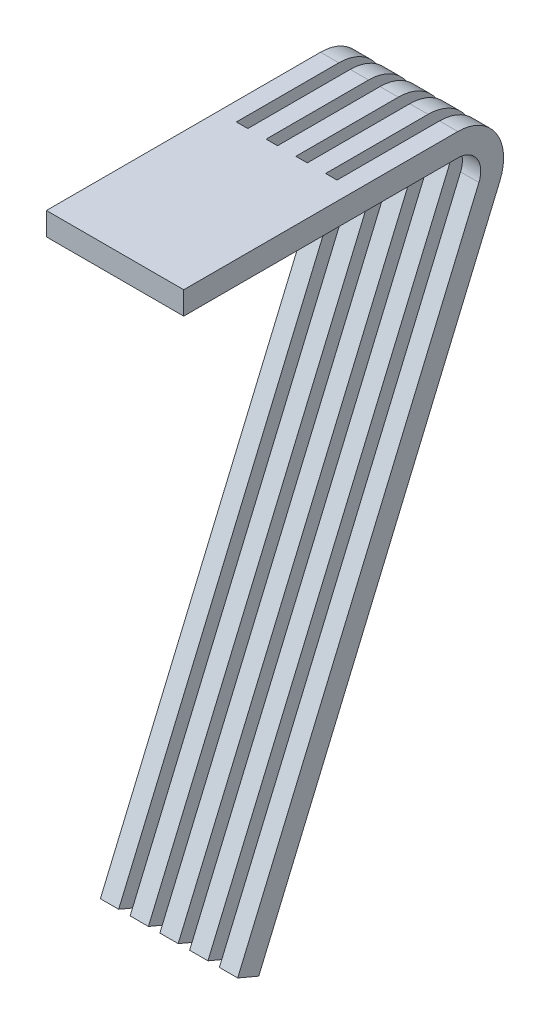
ISO-10303-21;
HEADER;
FILE_DESCRIPTION(('STEP AP214'),'2;1');
FILE_NAME('part.step','',(''),(''),'','','');
FILE_SCHEMA(('AUTOMOTIVE_DESIGN { 1 0 10303 214 1 1 1 1 }'));
ENDSEC;
DATA;
#1=APPLICATION_CONTEXT('core data for automotive mechanical design processes');
#2=APPLICATION_PROTOCOL_DEFINITION('international standard','automotive_design',2000,#1);
#3=PRODUCT_CONTEXT('',#1,'mechanical');
#4=PRODUCT('Part','Part','',(#3));
#5=PRODUCT_RELATED_PRODUCT_CATEGORY('part','',(#4));
#6=PRODUCT_DEFINITION_FORMATION('','',#4);
#7=PRODUCT_DEFINITION_CONTEXT('part definition',#1,'design');
#8=PRODUCT_DEFINITION('design','',#6,#7);
#9=PRODUCT_DEFINITION_SHAPE('','',#8);
#10=(LENGTH_UNIT() NAMED_UNIT(*) SI_UNIT(.MILLI.,.METRE.));
#11=(NAMED_UNIT(*) PLANE_ANGLE_UNIT() SI_UNIT($,.RADIAN.));
#12=(NAMED_UNIT(*) SI_UNIT($,.STERADIAN.) SOLID_ANGLE_UNIT());
#13=UNCERTAINTY_MEASURE_WITH_UNIT(LENGTH_MEASURE(1.E-05),#10,'distance_accuracy_value','');
#14=(GEOMETRIC_REPRESENTATION_CONTEXT(3) GLOBAL_UNCERTAINTY_ASSIGNED_CONTEXT((#13)) GLOBAL_UNIT_ASSIGNED_CONTEXT((#10,
#11,#12)) REPRESENTATION_CONTEXT('',''));
#15=CARTESIAN_POINT('',(0.,0.,0.));
#16=DIRECTION('',(0.,0.,1.));
#17=DIRECTION('',(1.,0.,0.));
#18=AXIS2_PLACEMENT_3D('',#15,#16,#17);
#19=CARTESIAN_POINT('',(-0.800000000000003,-0.400000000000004,-2.39566592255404));
#20=DIRECTION('',(-1.,0.,0.));
#21=DIRECTION('',(0.,-1.,0.));
#22=AXIS2_PLACEMENT_3D('',#19,#20,#21);
#23=CYLINDRICAL_SURFACE('',#22,0.4);
#24=CARTESIAN_POINT('',(-0.800000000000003,-0.400000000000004,-2.39566592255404));
#25=DIRECTION('',(-1.,0.,0.));
#26=DIRECTION('',(0.,-1.,0.));
#27=AXIS2_PLACEMENT_3D('',#24,#25,#26);
#28=CIRCLE('',#27,0.4);
#29=CARTESIAN_POINT('',(-0.800000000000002,0.,-2.39566592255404));
#30=VERTEX_POINT('',#29);
#31=CARTESIAN_POINT('',(-0.800000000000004,-0.556292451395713,-2.76386786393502));
#32=VERTEX_POINT('',#31);
#33=EDGE_CURVE('E314',#30,#32,#28,.T.);
#34=ORIENTED_EDGE('',*,*,#33,.T.);
#35=DIRECTION('',(1.,0.,0.));
#36=VECTOR('',#35,1.);
#37=CARTESIAN_POINT('',(-0.800000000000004,-0.556292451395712,-2.76386786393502));
#38=LINE('',#37,#36);
#39=CARTESIAN_POINT('',(-0.960000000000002,-0.556292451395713,-2.76386786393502));
#40=VERTEX_POINT('',#39);
#41=EDGE_CURVE('E273',#40,#32,#38,.T.);
#42=ORIENTED_EDGE('',*,*,#41,.F.);
#43=CARTESIAN_POINT('',(-0.960000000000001,-0.400000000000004,-2.39566592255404));
#44=DIRECTION('',(-1.,0.,0.));
#45=DIRECTION('',(0.,-1.,0.));
#46=AXIS2_PLACEMENT_3D('',#43,#44,#45);
#47=CIRCLE('',#46,0.4);
#48=CARTESIAN_POINT('',(-0.96,0.,-2.39566592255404));
#49=VERTEX_POINT('',#48);
#50=EDGE_CURVE('E21',#40,#49,#47,.F.);
#51=ORIENTED_EDGE('',*,*,#50,.T.);
#52=DIRECTION('',(-1.,0.,0.));
#53=VECTOR('',#52,1.);
#54=CARTESIAN_POINT('',(-0.800000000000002,0.,-2.39566592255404));
#55=LINE('',#54,#53);
#56=EDGE_CURVE('E277',#30,#49,#55,.T.);
#57=ORIENTED_EDGE('',*,*,#56,.F.);
#58=EDGE_LOOP('',(#34,#42,#51,#57));
#59=FACE_BOUND('',#58,.T.);
#60=ADVANCED_FACE('F17',(#59),#23,.T.);
#61=CARTESIAN_POINT('',(-0.800000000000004,-0.556292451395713,-2.76386786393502));
#62=DIRECTION('',(0.,-0.390731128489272,-0.920504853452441));
#63=DIRECTION('',(0.,0.920504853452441,-0.390731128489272));
#64=AXIS2_PLACEMENT_3D('',#61,#62,#63);
#65=PLANE('',#64);
#66=ORIENTED_EDGE('',*,*,#41,.T.);
#67=DIRECTION('',(0.,-0.920504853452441,0.390731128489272));
#68=VECTOR('',#67,1.);
#69=CARTESIAN_POINT('',(-0.800000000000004,-0.556292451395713,-2.76386786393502));
#70=LINE('',#69,#68);
#71=CARTESIAN_POINT('',(-0.800000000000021,-5.52302912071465,-0.65561322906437));
#72=VERTEX_POINT('',#71);
#73=EDGE_CURVE('E312',#32,#72,#70,.T.);
#74=ORIENTED_EDGE('',*,*,#73,.T.);
#75=DIRECTION('',(1.,0.,0.));
#76=VECTOR('',#75,1.);
#77=CARTESIAN_POINT('',(-0.800000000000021,-5.52302912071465,-0.655613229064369));
#78=LINE('',#77,#76);
#79=CARTESIAN_POINT('',(-0.960000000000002,-5.52302912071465,-0.65561322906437));
#80=VERTEX_POINT('',#79);
#81=EDGE_CURVE('E708',#80,#72,#78,.T.);
#82=ORIENTED_EDGE('',*,*,#81,.F.);
#83=DIRECTION('',(0.,0.920504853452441,-0.390731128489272));
#84=VECTOR('',#83,1.);
#85=CARTESIAN_POINT('',(-0.960000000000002,-5.52302912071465,-0.65561322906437));
#86=LINE('',#85,#84);
#87=EDGE_CURVE('E705',#80,#40,#86,.T.);
#88=ORIENTED_EDGE('',*,*,#87,.T.);
#89=EDGE_LOOP('',(#66,#74,#82,#88));
#90=FACE_BOUND('',#89,.T.);
#91=ADVANCED_FACE('F853',(#90),#65,.T.);
#92=CARTESIAN_POINT('',(-0.800000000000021,-5.52302912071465,-0.655613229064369));
#93=DIRECTION('',(0.,-0.92050485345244,0.390731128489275));
#94=DIRECTION('',(0.,-0.390731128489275,-0.92050485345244));
#95=AXIS2_PLACEMENT_3D('',#92,#93,#94);
#96=PLANE('',#95);
#97=DIRECTION('',(0.,0.390731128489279,0.920504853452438));
#98=VECTOR('',#97,1.);
#99=CARTESIAN_POINT('',(-0.800000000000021,-5.52302912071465,-0.655613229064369));
#100=LINE('',#99,#98);
#101=CARTESIAN_POINT('',(-0.800000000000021,-5.4448828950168,-0.471512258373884));
#102=VERTEX_POINT('',#101);
#103=EDGE_CURVE('E309',#72,#102,#100,.T.);
#104=ORIENTED_EDGE('',*,*,#103,.T.);
#105=DIRECTION('',(1.,0.,0.));
#106=VECTOR('',#105,1.);
#107=CARTESIAN_POINT('',(-0.800000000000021,-5.4448828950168,-0.471512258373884));
#108=LINE('',#107,#106);
#109=CARTESIAN_POINT('',(-0.960000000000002,-5.4448828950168,-0.471512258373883));
#110=VERTEX_POINT('',#109);
#111=EDGE_CURVE('E692',#110,#102,#108,.T.);
#112=ORIENTED_EDGE('',*,*,#111,.F.);
#113=DIRECTION('',(0.,-0.390731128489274,-0.92050485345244));
#114=VECTOR('',#113,1.);
#115=CARTESIAN_POINT('',(-0.960000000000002,-5.4448828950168,-0.471512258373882));
#116=LINE('',#115,#114);
#117=EDGE_CURVE('E299',#110,#80,#116,.T.);
#118=ORIENTED_EDGE('',*,*,#117,.T.);
#119=ORIENTED_EDGE('',*,*,#81,.T.);
#120=EDGE_LOOP('',(#104,#112,#118,#119));
#121=FACE_BOUND('',#120,.T.);
#122=ADVANCED_FACE('F858',(#121),#96,.T.);
#123=CARTESIAN_POINT('',(-0.800000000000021,-5.4448828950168,-0.471512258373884));
#124=DIRECTION('',(0.,0.390731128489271,0.920504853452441));
#125=DIRECTION('',(0.,-0.920504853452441,0.390731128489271));
#126=AXIS2_PLACEMENT_3D('',#123,#124,#125);
#127=PLANE('',#126);
#128=DIRECTION('',(0.,0.920504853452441,-0.390731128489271));
#129=VECTOR('',#128,1.);
#130=CARTESIAN_POINT('',(-0.800000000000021,-5.4448828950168,-0.471512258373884));
#131=LINE('',#130,#129);
#132=CARTESIAN_POINT('',(-0.800000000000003,-0.478146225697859,-2.57976689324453));
#133=VERTEX_POINT('',#132);
#134=EDGE_CURVE('E306',#102,#133,#131,.T.);
#135=ORIENTED_EDGE('',*,*,#134,.T.);
#136=DIRECTION('',(-1.,0.,0.));
#137=VECTOR('',#136,1.);
#138=CARTESIAN_POINT('',(-0.800000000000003,-0.478146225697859,-2.57976689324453));
#139=LINE('',#138,#137);
#140=CARTESIAN_POINT('',(-0.960000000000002,-0.478146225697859,-2.57976689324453));
#141=VERTEX_POINT('',#140);
#142=EDGE_CURVE('E703',#133,#141,#139,.T.);
#143=ORIENTED_EDGE('',*,*,#142,.T.);
#144=DIRECTION('',(0.,-0.920504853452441,0.390731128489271));
#145=VECTOR('',#144,1.);
#146=CARTESIAN_POINT('',(-0.960000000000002,-0.478146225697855,-2.57976689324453));
#147=LINE('',#146,#145);
#148=EDGE_CURVE('E296',#141,#110,#147,.T.);
#149=ORIENTED_EDGE('',*,*,#148,.T.);
#150=ORIENTED_EDGE('',*,*,#111,.T.);
#151=EDGE_LOOP('',(#135,#143,#149,#150));
#152=FACE_BOUND('',#151,.T.);
#153=ADVANCED_FACE('F861',(#152),#127,.T.);
#154=CARTESIAN_POINT('',(-0.800000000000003,-0.400000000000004,-2.39566592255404));
#155=DIRECTION('',(-1.,0.,0.));
#156=DIRECTION('',(0.,-1.,0.));
#157=AXIS2_PLACEMENT_3D('',#154,#155,#156);
#158=CYLINDRICAL_SURFACE('',#157,0.4);
#159=CARTESIAN_POINT('',(-2.,-0.4,-2.39566592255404));
#160=DIRECTION('',(-1.,0.,0.));
#161=DIRECTION('',(0.,-1.,0.));
#162=AXIS2_PLACEMENT_3D('',#159,#160,#161);
#163=CIRCLE('',#162,0.4);
#164=CARTESIAN_POINT('',(-2.,0.,-2.39566592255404));
#165=VERTEX_POINT('',#164);
#166=CARTESIAN_POINT('',(-2.,-0.556292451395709,-2.76386786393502));
#167=VERTEX_POINT('',#166);
#168=EDGE_CURVE('E331',#165,#167,#163,.T.);
#169=ORIENTED_EDGE('',*,*,#168,.F.);
#170=DIRECTION('',(-1.,0.,0.));
#171=VECTOR('',#170,1.);
#172=CARTESIAN_POINT('',(-0.800000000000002,0.,-2.39566592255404));
#173=LINE('',#172,#171);
#174=CARTESIAN_POINT('',(-1.84,0.,-2.39566592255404));
#175=VERTEX_POINT('',#174);
#176=EDGE_CURVE('E289',#175,#165,#173,.T.);
#177=ORIENTED_EDGE('',*,*,#176,.F.);
#178=CARTESIAN_POINT('',(-1.84,-0.400000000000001,-2.39566592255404));
#179=DIRECTION('',(-1.,0.,0.));
#180=DIRECTION('',(0.,-1.,0.));
#181=AXIS2_PLACEMENT_3D('',#178,#179,#180);
#182=CIRCLE('',#181,0.4);
#183=CARTESIAN_POINT('',(-1.84,-0.556292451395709,-2.76386786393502));
#184=VERTEX_POINT('',#183);
#185=EDGE_CURVE('E349',#175,#184,#182,.T.);
#186=ORIENTED_EDGE('',*,*,#185,.T.);
#187=DIRECTION('',(1.,0.,0.));
#188=VECTOR('',#187,1.);
#189=CARTESIAN_POINT('',(-0.800000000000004,-0.556292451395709,-2.76386786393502));
#190=LINE('',#189,#188);
#191=EDGE_CURVE('E687',#167,#184,#190,.T.);
#192=ORIENTED_EDGE('',*,*,#191,.F.);
#193=EDGE_LOOP('',(#169,#177,#186,#192));
#194=FACE_BOUND('',#193,.T.);
#195=ADVANCED_FACE('F840',(#194),#158,.T.);
#196=CARTESIAN_POINT('',(-0.800000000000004,-0.556292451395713,-2.76386786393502));
#197=DIRECTION('',(0.,-0.390731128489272,-0.920504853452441));
#198=DIRECTION('',(0.,0.920504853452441,-0.390731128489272));
#199=AXIS2_PLACEMENT_3D('',#196,#197,#198);
#200=PLANE('',#199);
#201=DIRECTION('',(0.,-0.920504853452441,0.390731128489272));
#202=VECTOR('',#201,1.);
#203=CARTESIAN_POINT('',(-2.,-0.556292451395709,-2.76386786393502));
#204=LINE('',#203,#202);
#205=CARTESIAN_POINT('',(-2.00000000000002,-5.52302912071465,-0.65561322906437));
#206=VERTEX_POINT('',#205);
#207=EDGE_CURVE('E328',#167,#206,#204,.T.);
#208=ORIENTED_EDGE('',*,*,#207,.F.);
#209=ORIENTED_EDGE('',*,*,#191,.T.);
#210=DIRECTION('',(0.,-0.920504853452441,0.390731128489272));
#211=VECTOR('',#210,1.);
#212=CARTESIAN_POINT('',(-1.84,-0.556292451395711,-2.76386786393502));
#213=LINE('',#212,#211);
#214=CARTESIAN_POINT('',(-1.84,-5.52302912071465,-0.65561322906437));
#215=VERTEX_POINT('',#214);
#216=EDGE_CURVE('E347',#184,#215,#213,.T.);
#217=ORIENTED_EDGE('',*,*,#216,.T.);
#218=DIRECTION('',(1.,0.,0.));
#219=VECTOR('',#218,1.);
#220=CARTESIAN_POINT('',(-0.800000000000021,-5.52302912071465,-0.655613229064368));
#221=LINE('',#220,#219);
#222=EDGE_CURVE('E679',#206,#215,#221,.T.);
#223=ORIENTED_EDGE('',*,*,#222,.F.);
#224=EDGE_LOOP('',(#208,#209,#217,#223));
#225=FACE_BOUND('',#224,.T.);
#226=ADVANCED_FACE('F869',(#225),#200,.T.);
#227=CARTESIAN_POINT('',(-0.800000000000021,-5.52302912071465,-0.655613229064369));
#228=DIRECTION('',(0.,-0.92050485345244,0.390731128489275));
#229=DIRECTION('',(0.,-0.390731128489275,-0.92050485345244));
#230=AXIS2_PLACEMENT_3D('',#227,#228,#229);
#231=PLANE('',#230);
#232=DIRECTION('',(0.,0.390731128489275,0.92050485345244));
#233=VECTOR('',#232,1.);
#234=CARTESIAN_POINT('',(-2.00000000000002,-5.52302912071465,-0.655613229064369));
#235=LINE('',#234,#233);
#236=CARTESIAN_POINT('',(-2.00000000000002,-5.44488289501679,-0.471512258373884));
#237=VERTEX_POINT('',#236);
#238=EDGE_CURVE('E325',#206,#237,#235,.T.);
#239=ORIENTED_EDGE('',*,*,#238,.F.);
#240=ORIENTED_EDGE('',*,*,#222,.T.);
#241=DIRECTION('',(0.,0.390731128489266,0.920504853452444));
#242=VECTOR('',#241,1.);
#243=CARTESIAN_POINT('',(-1.84,-5.52302912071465,-0.655613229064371));
#244=LINE('',#243,#242);
#245=CARTESIAN_POINT('',(-1.84,-5.44488289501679,-0.471512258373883));
#246=VERTEX_POINT('',#245);
#247=EDGE_CURVE('E344',#215,#246,#244,.T.);
#248=ORIENTED_EDGE('',*,*,#247,.T.);
#249=DIRECTION('',(1.,0.,0.));
#250=VECTOR('',#249,1.);
#251=CARTESIAN_POINT('',(-0.800000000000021,-5.44488289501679,-0.471512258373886));
#252=LINE('',#251,#250);
#253=EDGE_CURVE('E665',#237,#246,#252,.T.);
#254=ORIENTED_EDGE('',*,*,#253,.F.);
#255=EDGE_LOOP('',(#239,#240,#248,#254));
#256=FACE_BOUND('',#255,.T.);
#257=ADVANCED_FACE('F972',(#256),#231,.T.);
#258=CARTESIAN_POINT('',(-0.800000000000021,-5.4448828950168,-0.471512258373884));
#259=DIRECTION('',(0.,0.390731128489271,0.920504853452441));
#260=DIRECTION('',(0.,-0.920504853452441,0.390731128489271));
#261=AXIS2_PLACEMENT_3D('',#258,#259,#260);
#262=PLANE('',#261);
#263=DIRECTION('',(-1.,0.,0.));
#264=VECTOR('',#263,1.);
#265=CARTESIAN_POINT('',(-0.800000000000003,-0.478146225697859,-2.57976689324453));
#266=LINE('',#265,#264);
#267=CARTESIAN_POINT('',(-1.84,-0.478146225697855,-2.57976689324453));
#268=VERTEX_POINT('',#267);
#269=CARTESIAN_POINT('',(-2.,-0.478146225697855,-2.57976689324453));
#270=VERTEX_POINT('',#269);
#271=EDGE_CURVE('E324',#268,#270,#266,.T.);
#272=ORIENTED_EDGE('',*,*,#271,.T.);
#273=DIRECTION('',(0.,0.920504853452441,-0.390731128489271));
#274=VECTOR('',#273,1.);
#275=CARTESIAN_POINT('',(-2.00000000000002,-5.44488289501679,-0.471512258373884));
#276=LINE('',#275,#274);
#277=EDGE_CURVE('E321',#237,#270,#276,.T.);
#278=ORIENTED_EDGE('',*,*,#277,.F.);
#279=ORIENTED_EDGE('',*,*,#253,.T.);
#280=DIRECTION('',(0.,0.920504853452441,-0.390731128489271));
#281=VECTOR('',#280,1.);
#282=CARTESIAN_POINT('',(-1.84,-5.44488289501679,-0.471512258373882));
#283=LINE('',#282,#281);
#284=EDGE_CURVE('E340',#246,#268,#283,.T.);
#285=ORIENTED_EDGE('',*,*,#284,.T.);
#286=EDGE_LOOP('',(#272,#278,#279,#285));
#287=FACE_BOUND('',#286,.T.);
#288=ADVANCED_FACE('F969',(#287),#262,.T.);
#289=CARTESIAN_POINT('',(-0.800000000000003,-0.400000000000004,-2.39566592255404));
#290=DIRECTION('',(-1.,0.,0.));
#291=DIRECTION('',(0.,-1.,0.));
#292=AXIS2_PLACEMENT_3D('',#289,#290,#291);
#293=CYLINDRICAL_SURFACE('',#292,0.4);
#294=CARTESIAN_POINT('',(-1.74,-0.400000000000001,-2.39566592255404));
#295=DIRECTION('',(-1.,0.,0.));
#296=DIRECTION('',(0.,-1.,0.));
#297=AXIS2_PLACEMENT_3D('',#294,#295,#296);
#298=CIRCLE('',#297,0.4);
#299=CARTESIAN_POINT('',(-1.74,-0.556292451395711,-2.76386786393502));
#300=VERTEX_POINT('',#299);
#301=CARTESIAN_POINT('',(-1.74,0.,-2.39566592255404));
#302=VERTEX_POINT('',#301);
#303=EDGE_CURVE('E373',#300,#302,#298,.F.);
#304=ORIENTED_EDGE('',*,*,#303,.T.);
#305=DIRECTION('',(-1.,0.,0.));
#306=VECTOR('',#305,1.);
#307=CARTESIAN_POINT('',(-0.800000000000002,0.,-2.39566592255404));
#308=LINE('',#307,#306);
#309=CARTESIAN_POINT('',(-1.58,0.,-2.39566592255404));
#310=VERTEX_POINT('',#309);
#311=EDGE_CURVE('E640',#310,#302,#308,.T.);
#312=ORIENTED_EDGE('',*,*,#311,.F.);
#313=CARTESIAN_POINT('',(-1.58,-0.400000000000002,-2.39566592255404));
#314=DIRECTION('',(-1.,0.,0.));
#315=DIRECTION('',(0.,-1.,0.));
#316=AXIS2_PLACEMENT_3D('',#313,#314,#315);
#317=CIRCLE('',#316,0.4);
#318=CARTESIAN_POINT('',(-1.58,-0.556292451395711,-2.76386786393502));
#319=VERTEX_POINT('',#318);
#320=EDGE_CURVE('E385',#310,#319,#317,.T.);
#321=ORIENTED_EDGE('',*,*,#320,.T.);
#322=DIRECTION('',(1.,0.,0.));
#323=VECTOR('',#322,1.);
#324=CARTESIAN_POINT('',(-0.800000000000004,-0.556292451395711,-2.76386786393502));
#325=LINE('',#324,#323);
#326=EDGE_CURVE('E660',#300,#319,#325,.T.);
#327=ORIENTED_EDGE('',*,*,#326,.F.);
#328=EDGE_LOOP('',(#304,#312,#321,#327));
#329=FACE_BOUND('',#328,.T.);
#330=ADVANCED_FACE('F808',(#329),#293,.T.);
#331=CARTESIAN_POINT('',(-0.800000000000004,-0.556292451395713,-2.76386786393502));
#332=DIRECTION('',(0.,-0.390731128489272,-0.920504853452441));
#333=DIRECTION('',(0.,0.920504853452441,-0.390731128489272));
#334=AXIS2_PLACEMENT_3D('',#331,#332,#333);
#335=PLANE('',#334);
#336=DIRECTION('',(0.,0.920504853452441,-0.390731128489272));
#337=VECTOR('',#336,1.);
#338=CARTESIAN_POINT('',(-1.74,-5.52302912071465,-0.65561322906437));
#339=LINE('',#338,#337);
#340=CARTESIAN_POINT('',(-1.74,-5.52302912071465,-0.65561322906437));
#341=VERTEX_POINT('',#340);
#342=EDGE_CURVE('E358',#341,#300,#339,.T.);
#343=ORIENTED_EDGE('',*,*,#342,.T.);
#344=ORIENTED_EDGE('',*,*,#326,.T.);
#345=DIRECTION('',(0.,-0.920504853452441,0.390731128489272));
#346=VECTOR('',#345,1.);
#347=CARTESIAN_POINT('',(-1.58,-0.556292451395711,-2.76386786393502));
#348=LINE('',#347,#346);
#349=CARTESIAN_POINT('',(-1.58,-5.52302912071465,-0.655613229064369));
#350=VERTEX_POINT('',#349);
#351=EDGE_CURVE('E383',#319,#350,#348,.T.);
#352=ORIENTED_EDGE('',*,*,#351,.T.);
#353=DIRECTION('',(1.,0.,0.));
#354=VECTOR('',#353,1.);
#355=CARTESIAN_POINT('',(-0.800000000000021,-5.52302912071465,-0.655613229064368));
#356=LINE('',#355,#354);
#357=EDGE_CURVE('E652',#341,#350,#356,.T.);
#358=ORIENTED_EDGE('',*,*,#357,.F.);
#359=EDGE_LOOP('',(#343,#344,#352,#358));
#360=FACE_BOUND('',#359,.T.);
#361=ADVANCED_FACE('F810',(#360),#335,.T.);
#362=CARTESIAN_POINT('',(-0.800000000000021,-5.52302912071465,-0.655613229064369));
#363=DIRECTION('',(0.,-0.92050485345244,0.390731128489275));
#364=DIRECTION('',(0.,-0.390731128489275,-0.92050485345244));
#365=AXIS2_PLACEMENT_3D('',#362,#363,#364);
#366=PLANE('',#365);
#367=DIRECTION('',(0.,-0.390731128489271,-0.920504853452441));
#368=VECTOR('',#367,1.);
#369=CARTESIAN_POINT('',(-1.74,-5.44488289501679,-0.471512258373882));
#370=LINE('',#369,#368);
#371=CARTESIAN_POINT('',(-1.74,-5.44488289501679,-0.471512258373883));
#372=VERTEX_POINT('',#371);
#373=EDGE_CURVE('E362',#372,#341,#370,.T.);
#374=ORIENTED_EDGE('',*,*,#373,.T.);
#375=ORIENTED_EDGE('',*,*,#357,.T.);
#376=DIRECTION('',(0.,0.39073112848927,0.920504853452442));
#377=VECTOR('',#376,1.);
#378=CARTESIAN_POINT('',(-1.58,-5.52302912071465,-0.65561322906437));
#379=LINE('',#378,#377);
#380=CARTESIAN_POINT('',(-1.58,-5.44488289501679,-0.471512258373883));
#381=VERTEX_POINT('',#380);
#382=EDGE_CURVE('E380',#350,#381,#379,.T.);
#383=ORIENTED_EDGE('',*,*,#382,.T.);
#384=DIRECTION('',(1.,0.,0.));
#385=VECTOR('',#384,1.);
#386=CARTESIAN_POINT('',(-0.800000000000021,-5.44488289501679,-0.471512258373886));
#387=LINE('',#386,#385);
#388=EDGE_CURVE('E637',#372,#381,#387,.T.);
#389=ORIENTED_EDGE('',*,*,#388,.F.);
#390=EDGE_LOOP('',(#374,#375,#383,#389));
#391=FACE_BOUND('',#390,.T.);
#392=ADVANCED_FACE('F960',(#391),#366,.T.);
#393=CARTESIAN_POINT('',(-0.800000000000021,-5.4448828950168,-0.471512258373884));
#394=DIRECTION('',(0.,0.390731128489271,0.920504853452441));
#395=DIRECTION('',(0.,-0.920504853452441,0.390731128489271));
#396=AXIS2_PLACEMENT_3D('',#393,#394,#395);
#397=PLANE('',#396);
#398=DIRECTION('',(-1.,0.,0.));
#399=VECTOR('',#398,1.);
#400=CARTESIAN_POINT('',(-0.800000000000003,-0.478146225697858,-2.57976689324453));
#401=LINE('',#400,#399);
#402=CARTESIAN_POINT('',(-1.58,-0.478146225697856,-2.57976689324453));
#403=VERTEX_POINT('',#402);
#404=CARTESIAN_POINT('',(-1.74,-0.478146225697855,-2.57976689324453));
#405=VERTEX_POINT('',#404);
#406=EDGE_CURVE('E361',#403,#405,#401,.T.);
#407=ORIENTED_EDGE('',*,*,#406,.T.);
#408=DIRECTION('',(0.,-0.920504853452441,0.390731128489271));
#409=VECTOR('',#408,1.);
#410=CARTESIAN_POINT('',(-1.74,-0.478146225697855,-2.57976689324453));
#411=LINE('',#410,#409);
#412=EDGE_CURVE('E365',#405,#372,#411,.T.);
#413=ORIENTED_EDGE('',*,*,#412,.T.);
#414=ORIENTED_EDGE('',*,*,#388,.T.);
#415=DIRECTION('',(0.,0.920504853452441,-0.390731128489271));
#416=VECTOR('',#415,1.);
#417=CARTESIAN_POINT('',(-1.58,-5.44488289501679,-0.471512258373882));
#418=LINE('',#417,#416);
#419=EDGE_CURVE('E376',#381,#403,#418,.T.);
#420=ORIENTED_EDGE('',*,*,#419,.T.);
#421=EDGE_LOOP('',(#407,#413,#414,#420));
#422=FACE_BOUND('',#421,.T.);
#423=ADVANCED_FACE('F957',(#422),#397,.T.);
#424=CARTESIAN_POINT('',(-0.800000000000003,-0.400000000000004,-2.39566592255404));
#425=DIRECTION('',(-1.,0.,0.));
#426=DIRECTION('',(0.,-1.,0.));
#427=AXIS2_PLACEMENT_3D('',#424,#425,#426);
#428=CYLINDRICAL_SURFACE('',#427,0.4);
#429=CARTESIAN_POINT('',(-1.48,-0.400000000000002,-2.39566592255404));
#430=DIRECTION('',(-1.,0.,0.));
#431=DIRECTION('',(0.,-1.,0.));
#432=AXIS2_PLACEMENT_3D('',#429,#430,#431);
#433=CIRCLE('',#432,0.4);
#434=CARTESIAN_POINT('',(-1.48,-0.556292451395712,-2.76386786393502));
#435=VERTEX_POINT('',#434);
#436=CARTESIAN_POINT('',(-1.48,0.,-2.39566592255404));
#437=VERTEX_POINT('',#436);
#438=EDGE_CURVE('E409',#435,#437,#433,.F.);
#439=ORIENTED_EDGE('',*,*,#438,.T.);
#440=DIRECTION('',(-1.,0.,0.));
#441=VECTOR('',#440,1.);
#442=CARTESIAN_POINT('',(-0.800000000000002,0.,-2.39566592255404));
#443=LINE('',#442,#441);
#444=CARTESIAN_POINT('',(-1.32,0.,-2.39566592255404));
#445=VERTEX_POINT('',#444);
#446=EDGE_CURVE('E612',#445,#437,#443,.T.);
#447=ORIENTED_EDGE('',*,*,#446,.F.);
#448=CARTESIAN_POINT('',(-1.32,-0.400000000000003,-2.39566592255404));
#449=DIRECTION('',(-1.,0.,0.));
#450=DIRECTION('',(0.,-1.,0.));
#451=AXIS2_PLACEMENT_3D('',#448,#449,#450);
#452=CIRCLE('',#451,0.4);
#453=CARTESIAN_POINT('',(-1.32,-0.556292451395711,-2.76386786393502));
#454=VERTEX_POINT('',#453);
#455=EDGE_CURVE('E421',#445,#454,#452,.T.);
#456=ORIENTED_EDGE('',*,*,#455,.T.);
#457=DIRECTION('',(1.,0.,0.));
#458=VECTOR('',#457,1.);
#459=CARTESIAN_POINT('',(-0.800000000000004,-0.556292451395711,-2.76386786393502));
#460=LINE('',#459,#458);
#461=EDGE_CURVE('E632',#435,#454,#460,.T.);
#462=ORIENTED_EDGE('',*,*,#461,.F.);
#463=EDGE_LOOP('',(#439,#447,#456,#462));
#464=FACE_BOUND('',#463,.T.);
#465=ADVANCED_FACE('F953',(#464),#428,.T.);
#466=CARTESIAN_POINT('',(-0.800000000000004,-0.556292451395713,-2.76386786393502));
#467=DIRECTION('',(0.,-0.390731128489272,-0.920504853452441));
#468=DIRECTION('',(0.,0.920504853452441,-0.390731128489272));
#469=AXIS2_PLACEMENT_3D('',#466,#467,#468);
#470=PLANE('',#469);
#471=ORIENTED_EDGE('',*,*,#461,.T.);
#472=DIRECTION('',(0.,-0.920504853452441,0.390731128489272));
#473=VECTOR('',#472,1.);
#474=CARTESIAN_POINT('',(-1.32,-0.556292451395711,-2.76386786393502));
#475=LINE('',#474,#473);
#476=CARTESIAN_POINT('',(-1.32,-5.52302912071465,-0.65561322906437));
#477=VERTEX_POINT('',#476);
#478=EDGE_CURVE('E419',#454,#477,#475,.T.);
#479=ORIENTED_EDGE('',*,*,#478,.T.);
#480=DIRECTION('',(1.,0.,0.));
#481=VECTOR('',#480,1.);
#482=CARTESIAN_POINT('',(-0.800000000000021,-5.52302912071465,-0.655613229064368));
#483=LINE('',#482,#481);
#484=CARTESIAN_POINT('',(-1.48,-5.52302912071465,-0.65561322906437));
#485=VERTEX_POINT('',#484);
#486=EDGE_CURVE('E624',#485,#477,#483,.T.);
#487=ORIENTED_EDGE('',*,*,#486,.F.);
#488=DIRECTION('',(0.,0.920504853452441,-0.390731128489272));
#489=VECTOR('',#488,1.);
#490=CARTESIAN_POINT('',(-1.48,-5.52302912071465,-0.65561322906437));
#491=LINE('',#490,#489);
#492=EDGE_CURVE('E394',#485,#435,#491,.T.);
#493=ORIENTED_EDGE('',*,*,#492,.T.);
#494=EDGE_LOOP('',(#471,#479,#487,#493));
#495=FACE_BOUND('',#494,.T.);
#496=ADVANCED_FACE('F949',(#495),#470,.T.);
#497=CARTESIAN_POINT('',(-0.800000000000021,-5.52302912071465,-0.655613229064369));
#498=DIRECTION('',(0.,-0.92050485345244,0.390731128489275));
#499=DIRECTION('',(0.,-0.390731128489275,-0.92050485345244));
#500=AXIS2_PLACEMENT_3D('',#497,#498,#499);
#501=PLANE('',#500);
#502=DIRECTION('',(0.,0.390731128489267,0.920504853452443));
#503=VECTOR('',#502,1.);
#504=CARTESIAN_POINT('',(-1.32,-5.52302912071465,-0.65561322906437));
#505=LINE('',#504,#503);
#506=CARTESIAN_POINT('',(-1.32,-5.4448828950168,-0.471512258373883));
#507=VERTEX_POINT('',#506);
#508=EDGE_CURVE('E416',#477,#507,#505,.T.);
#509=ORIENTED_EDGE('',*,*,#508,.T.);
#510=DIRECTION('',(1.,0.,0.));
#511=VECTOR('',#510,1.);
#512=CARTESIAN_POINT('',(-0.800000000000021,-5.4448828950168,-0.471512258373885));
#513=LINE('',#512,#511);
#514=CARTESIAN_POINT('',(-1.48,-5.44488289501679,-0.471512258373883));
#515=VERTEX_POINT('',#514);
#516=EDGE_CURVE('E609',#515,#507,#513,.T.);
#517=ORIENTED_EDGE('',*,*,#516,.F.);
#518=DIRECTION('',(0.,-0.39073112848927,-0.920504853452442));
#519=VECTOR('',#518,1.);
#520=CARTESIAN_POINT('',(-1.48,-5.44488289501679,-0.471512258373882));
#521=LINE('',#520,#519);
#522=EDGE_CURVE('E398',#515,#485,#521,.T.);
#523=ORIENTED_EDGE('',*,*,#522,.T.);
#524=ORIENTED_EDGE('',*,*,#486,.T.);
#525=EDGE_LOOP('',(#509,#517,#523,#524));
#526=FACE_BOUND('',#525,.T.);
#527=ADVANCED_FACE('F945',(#526),#501,.T.);
#528=CARTESIAN_POINT('',(-0.800000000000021,-5.4448828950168,-0.471512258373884));
#529=DIRECTION('',(0.,0.390731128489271,0.920504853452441));
#530=DIRECTION('',(0.,-0.920504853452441,0.390731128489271));
#531=AXIS2_PLACEMENT_3D('',#528,#529,#530);
#532=PLANE('',#531);
#533=DIRECTION('',(0.,0.920504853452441,-0.390731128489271));
#534=VECTOR('',#533,1.);
#535=CARTESIAN_POINT('',(-1.32,-5.4448828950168,-0.471512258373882));
#536=LINE('',#535,#534);
#537=CARTESIAN_POINT('',(-1.32,-0.478146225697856,-2.57976689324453));
#538=VERTEX_POINT('',#537);
#539=EDGE_CURVE('E412',#507,#538,#536,.T.);
#540=ORIENTED_EDGE('',*,*,#539,.T.);
#541=DIRECTION('',(-1.,0.,0.));
#542=VECTOR('',#541,1.);
#543=CARTESIAN_POINT('',(-0.800000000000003,-0.478146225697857,-2.57976689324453));
#544=LINE('',#543,#542);
#545=CARTESIAN_POINT('',(-1.48,-0.478146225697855,-2.57976689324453));
#546=VERTEX_POINT('',#545);
#547=EDGE_CURVE('E397',#538,#546,#544,.T.);
#548=ORIENTED_EDGE('',*,*,#547,.T.);
#549=DIRECTION('',(0.,-0.920504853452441,0.390731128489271));
#550=VECTOR('',#549,1.);
#551=CARTESIAN_POINT('',(-1.48,-0.478146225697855,-2.57976689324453));
#552=LINE('',#551,#550);
#553=EDGE_CURVE('E401',#546,#515,#552,.T.);
#554=ORIENTED_EDGE('',*,*,#553,.T.);
#555=ORIENTED_EDGE('',*,*,#516,.T.);
#556=EDGE_LOOP('',(#540,#548,#554,#555));
#557=FACE_BOUND('',#556,.T.);
#558=ADVANCED_FACE('F942',(#557),#532,.T.);
#559=CARTESIAN_POINT('',(-0.800000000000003,-0.400000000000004,-2.39566592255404));
#560=DIRECTION('',(-1.,0.,0.));
#561=DIRECTION('',(0.,-1.,0.));
#562=AXIS2_PLACEMENT_3D('',#559,#560,#561);
#563=CYLINDRICAL_SURFACE('',#562,0.4);
#564=CARTESIAN_POINT('',(-1.22,-0.400000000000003,-2.39566592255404));
#565=DIRECTION('',(-1.,0.,0.));
#566=DIRECTION('',(0.,-1.,0.));
#567=AXIS2_PLACEMENT_3D('',#564,#565,#566);
#568=CIRCLE('',#567,0.4);
#569=CARTESIAN_POINT('',(-1.22,-0.556292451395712,-2.76386786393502));
#570=VERTEX_POINT('',#569);
#571=CARTESIAN_POINT('',(-1.22,0.,-2.39566592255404));
#572=VERTEX_POINT('',#571);
#573=EDGE_CURVE('E445',#570,#572,#568,.F.);
#574=ORIENTED_EDGE('',*,*,#573,.T.);
#575=DIRECTION('',(-1.,0.,0.));
#576=VECTOR('',#575,1.);
#577=CARTESIAN_POINT('',(-0.800000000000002,0.,-2.39566592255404));
#578=LINE('',#577,#576);
#579=CARTESIAN_POINT('',(-1.06,0.,-2.39566592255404));
#580=VERTEX_POINT('',#579);
#581=EDGE_CURVE('E595',#580,#572,#578,.T.);
#582=ORIENTED_EDGE('',*,*,#581,.F.);
#583=CARTESIAN_POINT('',(-1.06,-0.400000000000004,-2.39566592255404));
#584=DIRECTION('',(-1.,0.,0.));
#585=DIRECTION('',(0.,-1.,0.));
#586=AXIS2_PLACEMENT_3D('',#583,#584,#585);
#587=CIRCLE('',#586,0.4);
#588=CARTESIAN_POINT('',(-1.06,-0.556292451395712,-2.76386786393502));
#589=VERTEX_POINT('',#588);
#590=EDGE_CURVE('E456',#580,#589,#587,.T.);
#591=ORIENTED_EDGE('',*,*,#590,.T.);
#592=DIRECTION('',(1.,0.,0.));
#593=VECTOR('',#592,1.);
#594=CARTESIAN_POINT('',(-0.800000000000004,-0.556292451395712,-2.76386786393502));
#595=LINE('',#594,#593);
#596=EDGE_CURVE('E604',#570,#589,#595,.T.);
#597=ORIENTED_EDGE('',*,*,#596,.F.);
#598=EDGE_LOOP('',(#574,#582,#591,#597));
#599=FACE_BOUND('',#598,.T.);
#600=ADVANCED_FACE('F757',(#599),#563,.T.);
#601=CARTESIAN_POINT('',(-0.800000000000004,-0.556292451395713,-2.76386786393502));
#602=DIRECTION('',(0.,-0.390731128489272,-0.920504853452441));
#603=DIRECTION('',(0.,0.920504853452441,-0.390731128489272));
#604=AXIS2_PLACEMENT_3D('',#601,#602,#603);
#605=PLANE('',#604);
#606=ORIENTED_EDGE('',*,*,#596,.T.);
#607=DIRECTION('',(0.,-0.920504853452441,0.390731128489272));
#608=VECTOR('',#607,1.);
#609=CARTESIAN_POINT('',(-1.06,-0.556292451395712,-2.76386786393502));
#610=LINE('',#609,#608);
#611=CARTESIAN_POINT('',(-1.06,-5.52302912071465,-0.655613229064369));
#612=VERTEX_POINT('',#611);
#613=EDGE_CURVE('E454',#589,#612,#610,.T.);
#614=ORIENTED_EDGE('',*,*,#613,.T.);
#615=DIRECTION('',(1.,0.,0.));
#616=VECTOR('',#615,1.);
#617=CARTESIAN_POINT('',(-0.800000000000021,-5.52302912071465,-0.655613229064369));
#618=LINE('',#617,#616);
#619=CARTESIAN_POINT('',(-1.22,-5.52302912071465,-0.65561322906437));
#620=VERTEX_POINT('',#619);
#621=EDGE_CURVE('E596',#620,#612,#618,.T.);
#622=ORIENTED_EDGE('',*,*,#621,.F.);
#623=DIRECTION('',(0.,0.920504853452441,-0.390731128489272));
#624=VECTOR('',#623,1.);
#625=CARTESIAN_POINT('',(-1.22,-5.52302912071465,-0.65561322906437));
#626=LINE('',#625,#624);
#627=EDGE_CURVE('E430',#620,#570,#626,.T.);
#628=ORIENTED_EDGE('',*,*,#627,.T.);
#629=EDGE_LOOP('',(#606,#614,#622,#628));
#630=FACE_BOUND('',#629,.T.);
#631=ADVANCED_FACE('F759',(#630),#605,.T.);
#632=CARTESIAN_POINT('',(-0.800000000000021,-5.52302912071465,-0.655613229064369));
#633=DIRECTION('',(0.,-0.92050485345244,0.390731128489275));
#634=DIRECTION('',(0.,-0.390731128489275,-0.92050485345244));
#635=AXIS2_PLACEMENT_3D('',#632,#633,#634);
#636=PLANE('',#635);
#637=DIRECTION('',(0.,0.390731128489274,0.92050485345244));
#638=VECTOR('',#637,1.);
#639=CARTESIAN_POINT('',(-1.06,-5.52302912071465,-0.65561322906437));
#640=LINE('',#639,#638);
#641=CARTESIAN_POINT('',(-1.06,-5.4448828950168,-0.471512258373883));
#642=VERTEX_POINT('',#641);
#643=EDGE_CURVE('E451',#612,#642,#640,.T.);
#644=ORIENTED_EDGE('',*,*,#643,.T.);
#645=DIRECTION('',(1.,0.,0.));
#646=VECTOR('',#645,1.);
#647=CARTESIAN_POINT('',(-0.800000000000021,-5.4448828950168,-0.471512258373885));
#648=LINE('',#647,#646);
#649=CARTESIAN_POINT('',(-1.22,-5.4448828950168,-0.471512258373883));
#650=VERTEX_POINT('',#649);
#651=EDGE_CURVE('E592',#650,#642,#648,.T.);
#652=ORIENTED_EDGE('',*,*,#651,.F.);
#653=DIRECTION('',(0.,-0.390731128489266,-0.920504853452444));
#654=VECTOR('',#653,1.);
#655=CARTESIAN_POINT('',(-1.22,-5.4448828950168,-0.471512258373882));
#656=LINE('',#655,#654);
#657=EDGE_CURVE('E434',#650,#620,#656,.T.);
#658=ORIENTED_EDGE('',*,*,#657,.T.);
#659=ORIENTED_EDGE('',*,*,#621,.T.);
#660=EDGE_LOOP('',(#644,#652,#658,#659));
#661=FACE_BOUND('',#660,.T.);
#662=ADVANCED_FACE('F933',(#661),#636,.T.);
#663=CARTESIAN_POINT('',(-0.800000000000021,-5.4448828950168,-0.471512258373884));
#664=DIRECTION('',(0.,0.390731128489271,0.920504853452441));
#665=DIRECTION('',(0.,-0.920504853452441,0.390731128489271));
#666=AXIS2_PLACEMENT_3D('',#663,#664,#665);
#667=PLANE('',#666);
#668=DIRECTION('',(0.,0.920504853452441,-0.390731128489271));
#669=VECTOR('',#668,1.);
#670=CARTESIAN_POINT('',(-1.06,-5.4448828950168,-0.471512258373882));
#671=LINE('',#670,#669);
#672=CARTESIAN_POINT('',(-1.06,-0.478146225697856,-2.57976689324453));
#673=VERTEX_POINT('',#672);
#674=EDGE_CURVE('E448',#642,#673,#671,.T.);
#675=ORIENTED_EDGE('',*,*,#674,.T.);
#676=DIRECTION('',(-1.,0.,0.));
#677=VECTOR('',#676,1.);
#678=CARTESIAN_POINT('',(-0.800000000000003,-0.478146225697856,-2.57976689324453));
#679=LINE('',#678,#677);
#680=CARTESIAN_POINT('',(-1.22,-0.478146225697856,-2.57976689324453));
#681=VERTEX_POINT('',#680);
#682=EDGE_CURVE('E433',#673,#681,#679,.T.);
#683=ORIENTED_EDGE('',*,*,#682,.T.);
#684=DIRECTION('',(0.,-0.920504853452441,0.390731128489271));
#685=VECTOR('',#684,1.);
#686=CARTESIAN_POINT('',(-1.22,-0.478146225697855,-2.57976689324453));
#687=LINE('',#686,#685);
#688=EDGE_CURVE('E437',#681,#650,#687,.T.);
#689=ORIENTED_EDGE('',*,*,#688,.T.);
#690=ORIENTED_EDGE('',*,*,#651,.T.);
#691=EDGE_LOOP('',(#675,#683,#689,#690));
#692=FACE_BOUND('',#691,.T.);
#693=ADVANCED_FACE('F930',(#692),#667,.T.);
#694=CARTESIAN_POINT('',(-0.800000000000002,0.,0.));
#695=DIRECTION('',(0.,1.,0.));
#696=DIRECTION('',(-1.,0.,0.));
#697=AXIS2_PLACEMENT_3D('',#694,#695,#696);
#698=PLANE('',#697);
#699=DIRECTION('',(0.,0.,-1.));
#700=VECTOR('',#699,1.);
#701=CARTESIAN_POINT('',(-0.960000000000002,0.,-1.5));
#702=LINE('',#701,#700);
#703=CARTESIAN_POINT('',(-0.960000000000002,0.,-1.5));
#704=VERTEX_POINT('',#703);
#705=EDGE_CURVE('E282',#49,#704,#702,.F.);
#706=ORIENTED_EDGE('',*,*,#705,.T.);
#707=DIRECTION('',(1.,0.,0.));
#708=VECTOR('',#707,1.);
#709=CARTESIAN_POINT('',(-1.06,0.,-1.5));
#710=LINE('',#709,#708);
#711=CARTESIAN_POINT('',(-1.06,0.,-1.5));
#712=VERTEX_POINT('',#711);
#713=EDGE_CURVE('E477',#704,#712,#710,.F.);
#714=ORIENTED_EDGE('',*,*,#713,.T.);
#715=DIRECTION('',(0.,0.,1.));
#716=VECTOR('',#715,1.);
#717=CARTESIAN_POINT('',(-1.06,0.,-1.5));
#718=LINE('',#717,#716);
#719=EDGE_CURVE('E459',#712,#580,#718,.F.);
#720=ORIENTED_EDGE('',*,*,#719,.T.);
#721=ORIENTED_EDGE('',*,*,#581,.T.);
#722=DIRECTION('',(0.,0.,-1.));
#723=VECTOR('',#722,1.);
#724=CARTESIAN_POINT('',(-1.22,0.,-1.5));
#725=LINE('',#724,#723);
#726=CARTESIAN_POINT('',(-1.22,0.,-1.5));
#727=VERTEX_POINT('',#726);
#728=EDGE_CURVE('E443',#572,#727,#725,.F.);
#729=ORIENTED_EDGE('',*,*,#728,.T.);
#730=DIRECTION('',(1.,0.,0.));
#731=VECTOR('',#730,1.);
#732=CARTESIAN_POINT('',(-1.32,0.,-1.5));
#733=LINE('',#732,#731);
#734=CARTESIAN_POINT('',(-1.32,0.,-1.5));
#735=VERTEX_POINT('',#734);
#736=EDGE_CURVE('E415',#727,#735,#733,.F.);
#737=ORIENTED_EDGE('',*,*,#736,.T.);
#738=DIRECTION('',(0.,0.,1.));
#739=VECTOR('',#738,1.);
#740=CARTESIAN_POINT('',(-1.32,0.,-1.5));
#741=LINE('',#740,#739);
#742=EDGE_CURVE('E424',#735,#445,#741,.F.);
#743=ORIENTED_EDGE('',*,*,#742,.T.);
#744=ORIENTED_EDGE('',*,*,#446,.T.);
#745=DIRECTION('',(0.,0.,-1.));
#746=VECTOR('',#745,1.);
#747=CARTESIAN_POINT('',(-1.48,0.,-1.5));
#748=LINE('',#747,#746);
#749=CARTESIAN_POINT('',(-1.48,0.,-1.5));
#750=VERTEX_POINT('',#749);
#751=EDGE_CURVE('E407',#437,#750,#748,.F.);
#752=ORIENTED_EDGE('',*,*,#751,.T.);
#753=DIRECTION('',(1.,0.,0.));
#754=VECTOR('',#753,1.);
#755=CARTESIAN_POINT('',(-1.58,0.,-1.5));
#756=LINE('',#755,#754);
#757=CARTESIAN_POINT('',(-1.58,0.,-1.5));
#758=VERTEX_POINT('',#757);
#759=EDGE_CURVE('E379',#750,#758,#756,.F.);
#760=ORIENTED_EDGE('',*,*,#759,.T.);
#761=DIRECTION('',(0.,0.,1.));
#762=VECTOR('',#761,1.);
#763=CARTESIAN_POINT('',(-1.58,0.,-1.5));
#764=LINE('',#763,#762);
#765=EDGE_CURVE('E388',#758,#310,#764,.F.);
#766=ORIENTED_EDGE('',*,*,#765,.T.);
#767=ORIENTED_EDGE('',*,*,#311,.T.);
#768=DIRECTION('',(0.,0.,-1.));
#769=VECTOR('',#768,1.);
#770=CARTESIAN_POINT('',(-1.74,0.,-1.5));
#771=LINE('',#770,#769);
#772=CARTESIAN_POINT('',(-1.74,0.,-1.5));
#773=VERTEX_POINT('',#772);
#774=EDGE_CURVE('E371',#302,#773,#771,.F.);
#775=ORIENTED_EDGE('',*,*,#774,.T.);
#776=DIRECTION('',(1.,0.,0.));
#777=VECTOR('',#776,1.);
#778=CARTESIAN_POINT('',(-1.84,0.,-1.5));
#779=LINE('',#778,#777);
#780=CARTESIAN_POINT('',(-1.84,0.,-1.5));
#781=VERTEX_POINT('',#780);
#782=EDGE_CURVE('E343',#773,#781,#779,.F.);
#783=ORIENTED_EDGE('',*,*,#782,.T.);
#784=DIRECTION('',(0.,0.,1.));
#785=VECTOR('',#784,1.);
#786=CARTESIAN_POINT('',(-1.84,0.,-1.5));
#787=LINE('',#786,#785);
#788=EDGE_CURVE('E352',#781,#175,#787,.F.);
#789=ORIENTED_EDGE('',*,*,#788,.T.);
#790=ORIENTED_EDGE('',*,*,#176,.T.);
#791=DIRECTION('',(0.,0.,1.));
#792=VECTOR('',#791,1.);
#793=CARTESIAN_POINT('',(-2.,0.,-2.39566592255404));
#794=LINE('',#793,#792);
#795=CARTESIAN_POINT('',(-2.,0.,0.));
#796=VERTEX_POINT('',#795);
#797=EDGE_CURVE('E334',#796,#165,#794,.F.);
#798=ORIENTED_EDGE('',*,*,#797,.F.);
#799=DIRECTION('',(1.,0.,0.));
#800=VECTOR('',#799,1.);
#801=CARTESIAN_POINT('',(-0.800000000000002,0.,0.));
#802=LINE('',#801,#800);
#803=CARTESIAN_POINT('',(-0.800000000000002,0.,0.));
#804=VERTEX_POINT('',#803);
#805=EDGE_CURVE('E562',#804,#796,#802,.F.);
#806=ORIENTED_EDGE('',*,*,#805,.F.);
#807=DIRECTION('',(0.,0.,1.));
#808=VECTOR('',#807,1.);
#809=CARTESIAN_POINT('',(-0.800000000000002,0.,-2.39566592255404));
#810=LINE('',#809,#808);
#811=EDGE_CURVE('E287',#804,#30,#810,.F.);
#812=ORIENTED_EDGE('',*,*,#811,.T.);
#813=ORIENTED_EDGE('',*,*,#56,.T.);
#814=EDGE_LOOP('',(#706,#714,#720,#721,#729,#737,#743,#744,#752,#760,#766,#767,#775,#783,#789,
#790,#798,#806,#812,#813));
#815=FACE_BOUND('',#814,.T.);
#816=ADVANCED_FACE('F284',(#815),#698,.T.);
#817=CARTESIAN_POINT('',(-0.960000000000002,-5.52302912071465,-1.5));
#818=DIRECTION('',(1.,0.,0.));
#819=DIRECTION('',(0.,0.,-1.));
#820=AXIS2_PLACEMENT_3D('',#817,#818,#819);
#821=PLANE('',#820);
#822=ORIENTED_EDGE('',*,*,#117,.F.);
#823=ORIENTED_EDGE('',*,*,#148,.F.);
#824=CARTESIAN_POINT('',(-0.960000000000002,-0.400000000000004,-2.39566592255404));
#825=DIRECTION('',(-1.,0.,0.));
#826=DIRECTION('',(0.,-1.,0.));
#827=AXIS2_PLACEMENT_3D('',#824,#825,#826);
#828=CIRCLE('',#827,0.2);
#829=CARTESIAN_POINT('',(-0.960000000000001,-0.200000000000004,-2.39566592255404));
#830=VERTEX_POINT('',#829);
#831=EDGE_CURVE('E318',#141,#830,#828,.F.);
#832=ORIENTED_EDGE('',*,*,#831,.T.);
#833=DIRECTION('',(0.,0.,1.));
#834=VECTOR('',#833,1.);
#835=CARTESIAN_POINT('',(-0.960000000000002,-0.200000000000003,0.));
#836=LINE('',#835,#834);
#837=CARTESIAN_POINT('',(-0.960000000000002,-0.200000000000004,-1.5));
#838=VERTEX_POINT('',#837);
#839=EDGE_CURVE('E476',#838,#830,#836,.F.);
#840=ORIENTED_EDGE('',*,*,#839,.F.);
#841=DIRECTION('',(0.,1.,0.));
#842=VECTOR('',#841,1.);
#843=CARTESIAN_POINT('',(-0.960000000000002,-5.52302912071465,-1.5));
#844=LINE('',#843,#842);
#845=EDGE_CURVE('E294',#838,#704,#844,.T.);
#846=ORIENTED_EDGE('',*,*,#845,.T.);
#847=ORIENTED_EDGE('',*,*,#705,.F.);
#848=ORIENTED_EDGE('',*,*,#50,.F.);
#849=ORIENTED_EDGE('',*,*,#87,.F.);
#850=EDGE_LOOP('',(#822,#823,#832,#840,#846,#847,#848,#849));
#851=FACE_BOUND('',#850,.T.);
#852=ADVANCED_FACE('F292',(#851),#821,.F.);
#853=CARTESIAN_POINT('',(-0.800000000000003,-0.400000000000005,-2.39566592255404));
#854=DIRECTION('',(-1.,0.,0.));
#855=DIRECTION('',(0.,-1.,0.));
#856=AXIS2_PLACEMENT_3D('',#853,#854,#855);
#857=CYLINDRICAL_SURFACE('',#856,0.2);
#858=ORIENTED_EDGE('',*,*,#142,.F.);
#859=CARTESIAN_POINT('',(-0.800000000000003,-0.400000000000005,-2.39566592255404));
#860=DIRECTION('',(-1.,0.,0.));
#861=DIRECTION('',(0.,-1.,0.));
#862=AXIS2_PLACEMENT_3D('',#859,#860,#861);
#863=CIRCLE('',#862,0.2);
#864=CARTESIAN_POINT('',(-0.800000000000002,-0.200000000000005,-2.39566592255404));
#865=VERTEX_POINT('',#864);
#866=EDGE_CURVE('E308',#133,#865,#863,.F.);
#867=ORIENTED_EDGE('',*,*,#866,.T.);
#868=DIRECTION('',(1.,0.,0.));
#869=VECTOR('',#868,1.);
#870=CARTESIAN_POINT('',(-0.800000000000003,-0.200000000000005,-2.39566592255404));
#871=LINE('',#870,#869);
#872=EDGE_CURVE('E577',#830,#865,#871,.T.);
#873=ORIENTED_EDGE('',*,*,#872,.F.);
#874=ORIENTED_EDGE('',*,*,#831,.F.);
#875=EDGE_LOOP('',(#858,#867,#873,#874));
#876=FACE_BOUND('',#875,.T.);
#877=ADVANCED_FACE('F746',(#876),#857,.F.);
#878=CARTESIAN_POINT('',(-0.800000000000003,-0.400000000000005,-2.39566592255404));
#879=DIRECTION('',(-1.,0.,0.));
#880=DIRECTION('',(0.,-1.,0.));
#881=AXIS2_PLACEMENT_3D('',#878,#879,#880);
#882=PLANE('',#881);
#883=DIRECTION('',(0.,0.,1.));
#884=VECTOR('',#883,1.);
#885=CARTESIAN_POINT('',(-0.800000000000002,-0.200000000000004,0.));
#886=LINE('',#885,#884);
#887=CARTESIAN_POINT('',(-0.800000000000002,-0.200000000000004,0.));
#888=VERTEX_POINT('',#887);
#889=EDGE_CURVE('E567',#865,#888,#886,.T.);
#890=ORIENTED_EDGE('',*,*,#889,.F.);
#891=ORIENTED_EDGE('',*,*,#866,.F.);
#892=ORIENTED_EDGE('',*,*,#134,.F.);
#893=ORIENTED_EDGE('',*,*,#103,.F.);
#894=ORIENTED_EDGE('',*,*,#73,.F.);
#895=ORIENTED_EDGE('',*,*,#33,.F.);
#896=ORIENTED_EDGE('',*,*,#811,.F.);
#897=DIRECTION('',(0.,1.,0.));
#898=VECTOR('',#897,1.);
#899=CARTESIAN_POINT('',(-0.800000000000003,0.,0.));
#900=LINE('',#899,#898);
#901=EDGE_CURVE('E570',#888,#804,#900,.T.);
#902=ORIENTED_EDGE('',*,*,#901,.F.);
#903=EDGE_LOOP('',(#890,#891,#892,#893,#894,#895,#896,#902));
#904=FACE_BOUND('',#903,.T.);
#905=ADVANCED_FACE('F849',(#904),#882,.F.);
#906=CARTESIAN_POINT('',(-0.800000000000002,0.,0.));
#907=DIRECTION('',(0.,0.,1.));
#908=DIRECTION('',(1.,0.,0.));
#909=AXIS2_PLACEMENT_3D('',#906,#907,#908);
#910=PLANE('',#909);
#911=ORIENTED_EDGE('',*,*,#901,.T.);
#912=ORIENTED_EDGE('',*,*,#805,.T.);
#913=DIRECTION('',(0.,-1.,0.));
#914=VECTOR('',#913,1.);
#915=CARTESIAN_POINT('',(-2.,-0.400000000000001,0.));
#916=LINE('',#915,#914);
#917=CARTESIAN_POINT('',(-2.,-0.2,0.));
#918=VERTEX_POINT('',#917);
#919=EDGE_CURVE('E337',#918,#796,#916,.F.);
#920=ORIENTED_EDGE('',*,*,#919,.F.);
#921=DIRECTION('',(1.,0.,0.));
#922=VECTOR('',#921,1.);
#923=CARTESIAN_POINT('',(-0.800000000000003,-0.200000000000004,0.));
#924=LINE('',#923,#922);
#925=EDGE_CURVE('E557',#888,#918,#924,.F.);
#926=ORIENTED_EDGE('',*,*,#925,.F.);
#927=EDGE_LOOP('',(#911,#912,#920,#926));
#928=FACE_BOUND('',#927,.T.);
#929=ADVANCED_FACE('F847',(#928),#910,.T.);
#930=CARTESIAN_POINT('',(-2.,-0.400000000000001,-2.39566592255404));
#931=DIRECTION('',(-1.,0.,0.));
#932=DIRECTION('',(0.,-1.,0.));
#933=AXIS2_PLACEMENT_3D('',#930,#931,#932);
#934=PLANE('',#933);
#935=CARTESIAN_POINT('',(-2.,-0.400000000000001,-2.39566592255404));
#936=DIRECTION('',(-1.,0.,0.));
#937=DIRECTION('',(0.,-1.,0.));
#938=AXIS2_PLACEMENT_3D('',#935,#936,#937);
#939=CIRCLE('',#938,0.2);
#940=CARTESIAN_POINT('',(-2.,-0.200000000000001,-2.39566592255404));
#941=VERTEX_POINT('',#940);
#942=EDGE_CURVE('E695',#270,#941,#939,.F.);
#943=ORIENTED_EDGE('',*,*,#942,.T.);
#944=DIRECTION('',(0.,0.,1.));
#945=VECTOR('',#944,1.);
#946=CARTESIAN_POINT('',(-2.,-0.2,0.));
#947=LINE('',#946,#945);
#948=EDGE_CURVE('E554',#918,#941,#947,.F.);
#949=ORIENTED_EDGE('',*,*,#948,.F.);
#950=ORIENTED_EDGE('',*,*,#919,.T.);
#951=ORIENTED_EDGE('',*,*,#797,.T.);
#952=ORIENTED_EDGE('',*,*,#168,.T.);
#953=ORIENTED_EDGE('',*,*,#207,.T.);
#954=ORIENTED_EDGE('',*,*,#238,.T.);
#955=ORIENTED_EDGE('',*,*,#277,.T.);
#956=EDGE_LOOP('',(#943,#949,#950,#951,#952,#953,#954,#955));
#957=FACE_BOUND('',#956,.T.);
#958=ADVANCED_FACE('F843',(#957),#934,.T.);
#959=CARTESIAN_POINT('',(-0.800000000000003,-0.400000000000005,-2.39566592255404));
#960=DIRECTION('',(-1.,0.,0.));
#961=DIRECTION('',(0.,-1.,0.));
#962=AXIS2_PLACEMENT_3D('',#959,#960,#961);
#963=CYLINDRICAL_SURFACE('',#962,0.2);
#964=DIRECTION('',(1.,0.,0.));
#965=VECTOR('',#964,1.);
#966=CARTESIAN_POINT('',(-0.800000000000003,-0.200000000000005,-2.39566592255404));
#967=LINE('',#966,#965);
#968=CARTESIAN_POINT('',(-1.84,-0.200000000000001,-2.39566592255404));
#969=VERTEX_POINT('',#968);
#970=EDGE_CURVE('E549',#941,#969,#967,.T.);
#971=ORIENTED_EDGE('',*,*,#970,.F.);
#972=ORIENTED_EDGE('',*,*,#942,.F.);
#973=ORIENTED_EDGE('',*,*,#271,.F.);
#974=CARTESIAN_POINT('',(-1.84,-0.400000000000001,-2.39566592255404));
#975=DIRECTION('',(-1.,0.,0.));
#976=DIRECTION('',(0.,-1.,0.));
#977=AXIS2_PLACEMENT_3D('',#974,#975,#976);
#978=CIRCLE('',#977,0.2);
#979=EDGE_CURVE('E355',#268,#969,#978,.F.);
#980=ORIENTED_EDGE('',*,*,#979,.T.);
#981=EDGE_LOOP('',(#971,#972,#973,#980));
#982=FACE_BOUND('',#981,.T.);
#983=ADVANCED_FACE('F914',(#982),#963,.F.);
#984=CARTESIAN_POINT('',(-1.84,-5.52302912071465,-1.5));
#985=DIRECTION('',(-1.,0.,0.));
#986=DIRECTION('',(0.,0.,1.));
#987=AXIS2_PLACEMENT_3D('',#984,#985,#986);
#988=PLANE('',#987);
#989=ORIENTED_EDGE('',*,*,#247,.F.);
#990=ORIENTED_EDGE('',*,*,#216,.F.);
#991=ORIENTED_EDGE('',*,*,#185,.F.);
#992=ORIENTED_EDGE('',*,*,#788,.F.);
#993=DIRECTION('',(0.,1.,0.));
#994=VECTOR('',#993,1.);
#995=CARTESIAN_POINT('',(-1.84,-5.52302912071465,-1.5));
#996=LINE('',#995,#994);
#997=CARTESIAN_POINT('',(-1.84,-0.200000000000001,-1.5));
#998=VERTEX_POINT('',#997);
#999=EDGE_CURVE('E543',#781,#998,#996,.F.);
#1000=ORIENTED_EDGE('',*,*,#999,.T.);
#1001=DIRECTION('',(0.,0.,1.));
#1002=VECTOR('',#1001,1.);
#1003=CARTESIAN_POINT('',(-1.84,-0.2,0.));
#1004=LINE('',#1003,#1002);
#1005=EDGE_CURVE('E540',#969,#998,#1004,.T.);
#1006=ORIENTED_EDGE('',*,*,#1005,.F.);
#1007=ORIENTED_EDGE('',*,*,#979,.F.);
#1008=ORIENTED_EDGE('',*,*,#284,.F.);
#1009=EDGE_LOOP('',(#989,#990,#991,#992,#1000,#1006,#1007,#1008));
#1010=FACE_BOUND('',#1009,.T.);
#1011=ADVANCED_FACE('F833',(#1010),#988,.F.);
#1012=CARTESIAN_POINT('',(-1.84,-5.52302912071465,-1.5));
#1013=DIRECTION('',(0.,0.,1.));
#1014=DIRECTION('',(1.,0.,0.));
#1015=AXIS2_PLACEMENT_3D('',#1012,#1013,#1014);
#1016=PLANE('',#1015);
#1017=ORIENTED_EDGE('',*,*,#999,.F.);
#1018=ORIENTED_EDGE('',*,*,#782,.F.);
#1019=DIRECTION('',(0.,1.,0.));
#1020=VECTOR('',#1019,1.);
#1021=CARTESIAN_POINT('',(-1.74,-5.52302912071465,-1.5));
#1022=LINE('',#1021,#1020);
#1023=CARTESIAN_POINT('',(-1.74,-0.200000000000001,-1.5));
#1024=VERTEX_POINT('',#1023);
#1025=EDGE_CURVE('E368',#773,#1024,#1022,.F.);
#1026=ORIENTED_EDGE('',*,*,#1025,.T.);
#1027=DIRECTION('',(1.,0.,0.));
#1028=VECTOR('',#1027,1.);
#1029=CARTESIAN_POINT('',(-0.800000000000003,-0.200000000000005,-1.5));
#1030=LINE('',#1029,#1028);
#1031=EDGE_CURVE('E532',#998,#1024,#1030,.T.);
#1032=ORIENTED_EDGE('',*,*,#1031,.F.);
#1033=EDGE_LOOP('',(#1017,#1018,#1026,#1032));
#1034=FACE_BOUND('',#1033,.T.);
#1035=ADVANCED_FACE('F822',(#1034),#1016,.F.);
#1036=CARTESIAN_POINT('',(-1.74,-5.52302912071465,-1.5));
#1037=DIRECTION('',(1.,0.,0.));
#1038=DIRECTION('',(0.,0.,-1.));
#1039=AXIS2_PLACEMENT_3D('',#1036,#1037,#1038);
#1040=PLANE('',#1039);
#1041=ORIENTED_EDGE('',*,*,#373,.F.);
#1042=ORIENTED_EDGE('',*,*,#412,.F.);
#1043=CARTESIAN_POINT('',(-1.74,-0.400000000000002,-2.39566592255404));
#1044=DIRECTION('',(-1.,0.,0.));
#1045=DIRECTION('',(0.,-1.,0.));
#1046=AXIS2_PLACEMENT_3D('',#1043,#1044,#1045);
#1047=CIRCLE('',#1046,0.2);
#1048=CARTESIAN_POINT('',(-1.74,-0.200000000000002,-2.39566592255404));
#1049=VERTEX_POINT('',#1048);
#1050=EDGE_CURVE('E669',#405,#1049,#1047,.F.);
#1051=ORIENTED_EDGE('',*,*,#1050,.T.);
#1052=DIRECTION('',(0.,0.,1.));
#1053=VECTOR('',#1052,1.);
#1054=CARTESIAN_POINT('',(-1.74,-0.200000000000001,0.));
#1055=LINE('',#1054,#1053);
#1056=EDGE_CURVE('E529',#1024,#1049,#1055,.F.);
#1057=ORIENTED_EDGE('',*,*,#1056,.F.);
#1058=ORIENTED_EDGE('',*,*,#1025,.F.);
#1059=ORIENTED_EDGE('',*,*,#774,.F.);
#1060=ORIENTED_EDGE('',*,*,#303,.F.);
#1061=ORIENTED_EDGE('',*,*,#342,.F.);
#1062=EDGE_LOOP('',(#1041,#1042,#1051,#1057,#1058,#1059,#1060,#1061));
#1063=FACE_BOUND('',#1062,.T.);
#1064=ADVANCED_FACE('F816',(#1063),#1040,.F.);
#1065=CARTESIAN_POINT('',(-0.800000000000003,-0.400000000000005,-2.39566592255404));
#1066=DIRECTION('',(-1.,0.,0.));
#1067=DIRECTION('',(0.,-1.,0.));
#1068=AXIS2_PLACEMENT_3D('',#1065,#1066,#1067);
#1069=CYLINDRICAL_SURFACE('',#1068,0.2);
#1070=DIRECTION('',(1.,0.,0.));
#1071=VECTOR('',#1070,1.);
#1072=CARTESIAN_POINT('',(-0.800000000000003,-0.200000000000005,-2.39566592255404));
#1073=LINE('',#1072,#1071);
#1074=CARTESIAN_POINT('',(-1.58,-0.200000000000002,-2.39566592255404));
#1075=VERTEX_POINT('',#1074);
#1076=EDGE_CURVE('E524',#1049,#1075,#1073,.T.);
#1077=ORIENTED_EDGE('',*,*,#1076,.F.);
#1078=ORIENTED_EDGE('',*,*,#1050,.F.);
#1079=ORIENTED_EDGE('',*,*,#406,.F.);
#1080=CARTESIAN_POINT('',(-1.58,-0.400000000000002,-2.39566592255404));
#1081=DIRECTION('',(-1.,0.,0.));
#1082=DIRECTION('',(0.,-1.,0.));
#1083=AXIS2_PLACEMENT_3D('',#1080,#1081,#1082);
#1084=CIRCLE('',#1083,0.2);
#1085=EDGE_CURVE('E391',#403,#1075,#1084,.F.);
#1086=ORIENTED_EDGE('',*,*,#1085,.T.);
#1087=EDGE_LOOP('',(#1077,#1078,#1079,#1086));
#1088=FACE_BOUND('',#1087,.T.);
#1089=ADVANCED_FACE('F904',(#1088),#1069,.F.);
#1090=CARTESIAN_POINT('',(-1.58,-5.52302912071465,-1.5));
#1091=DIRECTION('',(-1.,0.,0.));
#1092=DIRECTION('',(0.,0.,1.));
#1093=AXIS2_PLACEMENT_3D('',#1090,#1091,#1092);
#1094=PLANE('',#1093);
#1095=ORIENTED_EDGE('',*,*,#382,.F.);
#1096=ORIENTED_EDGE('',*,*,#351,.F.);
#1097=ORIENTED_EDGE('',*,*,#320,.F.);
#1098=ORIENTED_EDGE('',*,*,#765,.F.);
#1099=DIRECTION('',(0.,1.,0.));
#1100=VECTOR('',#1099,1.);
#1101=CARTESIAN_POINT('',(-1.58,-5.52302912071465,-1.5));
#1102=LINE('',#1101,#1100);
#1103=CARTESIAN_POINT('',(-1.58,-0.200000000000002,-1.5));
#1104=VERTEX_POINT('',#1103);
#1105=EDGE_CURVE('E518',#758,#1104,#1102,.F.);
#1106=ORIENTED_EDGE('',*,*,#1105,.T.);
#1107=DIRECTION('',(0.,0.,1.));
#1108=VECTOR('',#1107,1.);
#1109=CARTESIAN_POINT('',(-1.58,-0.200000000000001,0.));
#1110=LINE('',#1109,#1108);
#1111=EDGE_CURVE('E515',#1075,#1104,#1110,.T.);
#1112=ORIENTED_EDGE('',*,*,#1111,.F.);
#1113=ORIENTED_EDGE('',*,*,#1085,.F.);
#1114=ORIENTED_EDGE('',*,*,#419,.F.);
#1115=EDGE_LOOP('',(#1095,#1096,#1097,#1098,#1106,#1112,#1113,#1114));
#1116=FACE_BOUND('',#1115,.T.);
#1117=ADVANCED_FACE('F804',(#1116),#1094,.F.);
#1118=CARTESIAN_POINT('',(-1.58,-5.52302912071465,-1.5));
#1119=DIRECTION('',(0.,0.,1.));
#1120=DIRECTION('',(1.,0.,0.));
#1121=AXIS2_PLACEMENT_3D('',#1118,#1119,#1120);
#1122=PLANE('',#1121);
#1123=ORIENTED_EDGE('',*,*,#1105,.F.);
#1124=ORIENTED_EDGE('',*,*,#759,.F.);
#1125=DIRECTION('',(0.,1.,0.));
#1126=VECTOR('',#1125,1.);
#1127=CARTESIAN_POINT('',(-1.48,-5.52302912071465,-1.5));
#1128=LINE('',#1127,#1126);
#1129=CARTESIAN_POINT('',(-1.48,-0.200000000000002,-1.5));
#1130=VERTEX_POINT('',#1129);
#1131=EDGE_CURVE('E404',#750,#1130,#1128,.F.);
#1132=ORIENTED_EDGE('',*,*,#1131,.T.);
#1133=DIRECTION('',(1.,0.,0.));
#1134=VECTOR('',#1133,1.);
#1135=CARTESIAN_POINT('',(-0.800000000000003,-0.200000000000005,-1.5));
#1136=LINE('',#1135,#1134);
#1137=EDGE_CURVE('E507',#1104,#1130,#1136,.T.);
#1138=ORIENTED_EDGE('',*,*,#1137,.F.);
#1139=EDGE_LOOP('',(#1123,#1124,#1132,#1138));
#1140=FACE_BOUND('',#1139,.T.);
#1141=ADVANCED_FACE('F799',(#1140),#1122,.F.);
#1142=CARTESIAN_POINT('',(-1.48,-5.52302912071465,-1.5));
#1143=DIRECTION('',(1.,0.,0.));
#1144=DIRECTION('',(0.,0.,-1.));
#1145=AXIS2_PLACEMENT_3D('',#1142,#1143,#1144);
#1146=PLANE('',#1145);
#1147=ORIENTED_EDGE('',*,*,#522,.F.);
#1148=ORIENTED_EDGE('',*,*,#553,.F.);
#1149=CARTESIAN_POINT('',(-1.48,-0.400000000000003,-2.39566592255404));
#1150=DIRECTION('',(-1.,0.,0.));
#1151=DIRECTION('',(0.,-1.,0.));
#1152=AXIS2_PLACEMENT_3D('',#1149,#1150,#1151);
#1153=CIRCLE('',#1152,0.2);
#1154=CARTESIAN_POINT('',(-1.48,-0.200000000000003,-2.39566592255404));
#1155=VERTEX_POINT('',#1154);
#1156=EDGE_CURVE('E642',#546,#1155,#1153,.F.);
#1157=ORIENTED_EDGE('',*,*,#1156,.T.);
#1158=DIRECTION('',(0.,0.,1.));
#1159=VECTOR('',#1158,1.);
#1160=CARTESIAN_POINT('',(-1.48,-0.200000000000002,0.));
#1161=LINE('',#1160,#1159);
#1162=EDGE_CURVE('E504',#1130,#1155,#1161,.F.);
#1163=ORIENTED_EDGE('',*,*,#1162,.F.);
#1164=ORIENTED_EDGE('',*,*,#1131,.F.);
#1165=ORIENTED_EDGE('',*,*,#751,.F.);
#1166=ORIENTED_EDGE('',*,*,#438,.F.);
#1167=ORIENTED_EDGE('',*,*,#492,.F.);
#1168=EDGE_LOOP('',(#1147,#1148,#1157,#1163,#1164,#1165,#1166,#1167));
#1169=FACE_BOUND('',#1168,.T.);
#1170=ADVANCED_FACE('F793',(#1169),#1146,.F.);
#1171=CARTESIAN_POINT('',(-0.800000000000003,-0.400000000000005,-2.39566592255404));
#1172=DIRECTION('',(-1.,0.,0.));
#1173=DIRECTION('',(0.,-1.,0.));
#1174=AXIS2_PLACEMENT_3D('',#1171,#1172,#1173);
#1175=CYLINDRICAL_SURFACE('',#1174,0.2);
#1176=DIRECTION('',(1.,0.,0.));
#1177=VECTOR('',#1176,1.);
#1178=CARTESIAN_POINT('',(-0.800000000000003,-0.200000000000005,-2.39566592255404));
#1179=LINE('',#1178,#1177);
#1180=CARTESIAN_POINT('',(-1.32,-0.200000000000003,-2.39566592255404));
#1181=VERTEX_POINT('',#1180);
#1182=EDGE_CURVE('E499',#1155,#1181,#1179,.T.);
#1183=ORIENTED_EDGE('',*,*,#1182,.F.);
#1184=ORIENTED_EDGE('',*,*,#1156,.F.);
#1185=ORIENTED_EDGE('',*,*,#547,.F.);
#1186=CARTESIAN_POINT('',(-1.32,-0.400000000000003,-2.39566592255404));
#1187=DIRECTION('',(-1.,0.,0.));
#1188=DIRECTION('',(0.,-1.,0.));
#1189=AXIS2_PLACEMENT_3D('',#1186,#1187,#1188);
#1190=CIRCLE('',#1189,0.2);
#1191=EDGE_CURVE('E427',#538,#1181,#1190,.F.);
#1192=ORIENTED_EDGE('',*,*,#1191,.T.);
#1193=EDGE_LOOP('',(#1183,#1184,#1185,#1192));
#1194=FACE_BOUND('',#1193,.T.);
#1195=ADVANCED_FACE('F894',(#1194),#1175,.F.);
#1196=CARTESIAN_POINT('',(-1.32,-5.52302912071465,-1.5));
#1197=DIRECTION('',(-1.,0.,0.));
#1198=DIRECTION('',(0.,0.,1.));
#1199=AXIS2_PLACEMENT_3D('',#1196,#1197,#1198);
#1200=PLANE('',#1199);
#1201=ORIENTED_EDGE('',*,*,#508,.F.);
#1202=ORIENTED_EDGE('',*,*,#478,.F.);
#1203=ORIENTED_EDGE('',*,*,#455,.F.);
#1204=ORIENTED_EDGE('',*,*,#742,.F.);
#1205=DIRECTION('',(0.,1.,0.));
#1206=VECTOR('',#1205,1.);
#1207=CARTESIAN_POINT('',(-1.32,-5.52302912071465,-1.5));
#1208=LINE('',#1207,#1206);
#1209=CARTESIAN_POINT('',(-1.32,-0.200000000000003,-1.5));
#1210=VERTEX_POINT('',#1209);
#1211=EDGE_CURVE('E493',#735,#1210,#1208,.F.);
#1212=ORIENTED_EDGE('',*,*,#1211,.T.);
#1213=DIRECTION('',(0.,0.,1.));
#1214=VECTOR('',#1213,1.);
#1215=CARTESIAN_POINT('',(-1.32,-0.200000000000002,0.));
#1216=LINE('',#1215,#1214);
#1217=EDGE_CURVE('E490',#1181,#1210,#1216,.T.);
#1218=ORIENTED_EDGE('',*,*,#1217,.F.);
#1219=ORIENTED_EDGE('',*,*,#1191,.F.);
#1220=ORIENTED_EDGE('',*,*,#539,.F.);
#1221=EDGE_LOOP('',(#1201,#1202,#1203,#1204,#1212,#1218,#1219,#1220));
#1222=FACE_BOUND('',#1221,.T.);
#1223=ADVANCED_FACE('F782',(#1222),#1200,.F.);
#1224=CARTESIAN_POINT('',(-1.32,-5.52302912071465,-1.5));
#1225=DIRECTION('',(0.,0.,1.));
#1226=DIRECTION('',(1.,0.,0.));
#1227=AXIS2_PLACEMENT_3D('',#1224,#1225,#1226);
#1228=PLANE('',#1227);
#1229=ORIENTED_EDGE('',*,*,#1211,.F.);
#1230=ORIENTED_EDGE('',*,*,#736,.F.);
#1231=DIRECTION('',(0.,1.,0.));
#1232=VECTOR('',#1231,1.);
#1233=CARTESIAN_POINT('',(-1.22,-5.52302912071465,-1.5));
#1234=LINE('',#1233,#1232);
#1235=CARTESIAN_POINT('',(-1.22,-0.200000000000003,-1.5));
#1236=VERTEX_POINT('',#1235);
#1237=EDGE_CURVE('E440',#727,#1236,#1234,.F.);
#1238=ORIENTED_EDGE('',*,*,#1237,.T.);
#1239=DIRECTION('',(1.,0.,0.));
#1240=VECTOR('',#1239,1.);
#1241=CARTESIAN_POINT('',(-0.800000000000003,-0.200000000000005,-1.5));
#1242=LINE('',#1241,#1240);
#1243=EDGE_CURVE('E482',#1210,#1236,#1242,.T.);
#1244=ORIENTED_EDGE('',*,*,#1243,.F.);
#1245=EDGE_LOOP('',(#1229,#1230,#1238,#1244));
#1246=FACE_BOUND('',#1245,.T.);
#1247=ADVANCED_FACE('F771',(#1246),#1228,.F.);
#1248=CARTESIAN_POINT('',(-1.22,-5.52302912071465,-1.5));
#1249=DIRECTION('',(1.,0.,0.));
#1250=DIRECTION('',(0.,0.,-1.));
#1251=AXIS2_PLACEMENT_3D('',#1248,#1249,#1250);
#1252=PLANE('',#1251);
#1253=ORIENTED_EDGE('',*,*,#657,.F.);
#1254=ORIENTED_EDGE('',*,*,#688,.F.);
#1255=CARTESIAN_POINT('',(-1.22,-0.400000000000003,-2.39566592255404));
#1256=DIRECTION('',(-1.,0.,0.));
#1257=DIRECTION('',(0.,-1.,0.));
#1258=AXIS2_PLACEMENT_3D('',#1255,#1256,#1257);
#1259=CIRCLE('',#1258,0.2);
#1260=CARTESIAN_POINT('',(-1.22,-0.200000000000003,-2.39566592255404));
#1261=VERTEX_POINT('',#1260);
#1262=EDGE_CURVE('E614',#681,#1261,#1259,.F.);
#1263=ORIENTED_EDGE('',*,*,#1262,.T.);
#1264=DIRECTION('',(0.,0.,1.));
#1265=VECTOR('',#1264,1.);
#1266=CARTESIAN_POINT('',(-1.22,-0.200000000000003,0.));
#1267=LINE('',#1266,#1265);
#1268=EDGE_CURVE('E468',#1236,#1261,#1267,.F.);
#1269=ORIENTED_EDGE('',*,*,#1268,.F.);
#1270=ORIENTED_EDGE('',*,*,#1237,.F.);
#1271=ORIENTED_EDGE('',*,*,#728,.F.);
#1272=ORIENTED_EDGE('',*,*,#573,.F.);
#1273=ORIENTED_EDGE('',*,*,#627,.F.);
#1274=EDGE_LOOP('',(#1253,#1254,#1263,#1269,#1270,#1271,#1272,#1273));
#1275=FACE_BOUND('',#1274,.T.);
#1276=ADVANCED_FACE('F765',(#1275),#1252,.F.);
#1277=CARTESIAN_POINT('',(-0.800000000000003,-0.400000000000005,-2.39566592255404));
#1278=DIRECTION('',(-1.,0.,0.));
#1279=DIRECTION('',(0.,-1.,0.));
#1280=AXIS2_PLACEMENT_3D('',#1277,#1278,#1279);
#1281=CYLINDRICAL_SURFACE('',#1280,0.2);
#1282=DIRECTION('',(1.,0.,0.));
#1283=VECTOR('',#1282,1.);
#1284=CARTESIAN_POINT('',(-0.800000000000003,-0.200000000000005,-2.39566592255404));
#1285=LINE('',#1284,#1283);
#1286=CARTESIAN_POINT('',(-1.06,-0.200000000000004,-2.39566592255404));
#1287=VERTEX_POINT('',#1286);
#1288=EDGE_CURVE('E465',#1261,#1287,#1285,.T.);
#1289=ORIENTED_EDGE('',*,*,#1288,.F.);
#1290=ORIENTED_EDGE('',*,*,#1262,.F.);
#1291=ORIENTED_EDGE('',*,*,#682,.F.);
#1292=CARTESIAN_POINT('',(-1.06,-0.400000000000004,-2.39566592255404));
#1293=DIRECTION('',(-1.,0.,0.));
#1294=DIRECTION('',(0.,-1.,0.));
#1295=AXIS2_PLACEMENT_3D('',#1292,#1293,#1294);
#1296=CIRCLE('',#1295,0.2);
#1297=EDGE_CURVE('E462',#673,#1287,#1296,.F.);
#1298=ORIENTED_EDGE('',*,*,#1297,.T.);
#1299=EDGE_LOOP('',(#1289,#1290,#1291,#1298));
#1300=FACE_BOUND('',#1299,.T.);
#1301=ADVANCED_FACE('F882',(#1300),#1281,.F.);
#1302=CARTESIAN_POINT('',(-1.06,-5.52302912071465,-1.5));
#1303=DIRECTION('',(-1.,0.,0.));
#1304=DIRECTION('',(0.,0.,1.));
#1305=AXIS2_PLACEMENT_3D('',#1302,#1303,#1304);
#1306=PLANE('',#1305);
#1307=ORIENTED_EDGE('',*,*,#643,.F.);
#1308=ORIENTED_EDGE('',*,*,#613,.F.);
#1309=ORIENTED_EDGE('',*,*,#590,.F.);
#1310=ORIENTED_EDGE('',*,*,#719,.F.);
#1311=DIRECTION('',(0.,1.,0.));
#1312=VECTOR('',#1311,1.);
#1313=CARTESIAN_POINT('',(-1.06,-5.52302912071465,-1.5));
#1314=LINE('',#1313,#1312);
#1315=CARTESIAN_POINT('',(-1.06,-0.200000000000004,-1.5));
#1316=VERTEX_POINT('',#1315);
#1317=EDGE_CURVE('E36',#712,#1316,#1314,.F.);
#1318=ORIENTED_EDGE('',*,*,#1317,.T.);
#1319=DIRECTION('',(0.,0.,1.));
#1320=VECTOR('',#1319,1.);
#1321=CARTESIAN_POINT('',(-1.06,-0.200000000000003,0.));
#1322=LINE('',#1321,#1320);
#1323=EDGE_CURVE('E27',#1287,#1316,#1322,.T.);
#1324=ORIENTED_EDGE('',*,*,#1323,.F.);
#1325=ORIENTED_EDGE('',*,*,#1297,.F.);
#1326=ORIENTED_EDGE('',*,*,#674,.F.);
#1327=EDGE_LOOP('',(#1307,#1308,#1309,#1310,#1318,#1324,#1325,#1326));
#1328=FACE_BOUND('',#1327,.T.);
#1329=ADVANCED_FACE('F754',(#1328),#1306,.F.);
#1330=CARTESIAN_POINT('',(-1.06,-5.52302912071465,-1.5));
#1331=DIRECTION('',(0.,0.,1.));
#1332=DIRECTION('',(1.,0.,0.));
#1333=AXIS2_PLACEMENT_3D('',#1330,#1331,#1332);
#1334=PLANE('',#1333);
#1335=ORIENTED_EDGE('',*,*,#1317,.F.);
#1336=ORIENTED_EDGE('',*,*,#713,.F.);
#1337=ORIENTED_EDGE('',*,*,#845,.F.);
#1338=DIRECTION('',(1.,0.,0.));
#1339=VECTOR('',#1338,1.);
#1340=CARTESIAN_POINT('',(-0.800000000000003,-0.200000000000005,-1.5));
#1341=LINE('',#1340,#1339);
#1342=EDGE_CURVE('E11',#1316,#838,#1341,.T.);
#1343=ORIENTED_EDGE('',*,*,#1342,.F.);
#1344=EDGE_LOOP('',(#1335,#1336,#1337,#1343));
#1345=FACE_BOUND('',#1344,.T.);
#1346=ADVANCED_FACE('F751',(#1345),#1334,.F.);
#1347=CARTESIAN_POINT('',(-0.800000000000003,-0.200000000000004,0.));
#1348=DIRECTION('',(0.,-1.,0.));
#1349=DIRECTION('',(1.,0.,0.));
#1350=AXIS2_PLACEMENT_3D('',#1347,#1348,#1349);
#1351=PLANE('',#1350);
#1352=ORIENTED_EDGE('',*,*,#1323,.T.);
#1353=ORIENTED_EDGE('',*,*,#1342,.T.);
#1354=ORIENTED_EDGE('',*,*,#839,.T.);
#1355=ORIENTED_EDGE('',*,*,#872,.T.);
#1356=ORIENTED_EDGE('',*,*,#889,.T.);
#1357=ORIENTED_EDGE('',*,*,#925,.T.);
#1358=ORIENTED_EDGE('',*,*,#948,.T.);
#1359=ORIENTED_EDGE('',*,*,#970,.T.);
#1360=ORIENTED_EDGE('',*,*,#1005,.T.);
#1361=ORIENTED_EDGE('',*,*,#1031,.T.);
#1362=ORIENTED_EDGE('',*,*,#1056,.T.);
#1363=ORIENTED_EDGE('',*,*,#1076,.T.);
#1364=ORIENTED_EDGE('',*,*,#1111,.T.);
#1365=ORIENTED_EDGE('',*,*,#1137,.T.);
#1366=ORIENTED_EDGE('',*,*,#1162,.T.);
#1367=ORIENTED_EDGE('',*,*,#1182,.T.);
#1368=ORIENTED_EDGE('',*,*,#1217,.T.);
#1369=ORIENTED_EDGE('',*,*,#1243,.T.);
#1370=ORIENTED_EDGE('',*,*,#1268,.T.);
#1371=ORIENTED_EDGE('',*,*,#1288,.T.);
#1372=EDGE_LOOP('',(#1352,#1353,#1354,#1355,#1356,#1357,#1358,#1359,#1360,#1361,#1362,#1363,
#1364,#1365,#1366,#1367,#1368,#1369,#1370,#1371));
#1373=FACE_BOUND('',#1372,.T.);
#1374=ADVANCED_FACE('F19',(#1373),#1351,.T.);
#1375=CLOSED_SHELL('',(#60,#91,#122,#153,#195,#226,#257,#288,#330,#361,#392,#423,#465,#496,#527,
#558,#600,#631,#662,#693,#816,#852,#877,#905,#929,#958,#983,#1011,#1035,#1064,#1089,#1117,#1141,
#1170,#1195,#1223,#1247,#1276,#1301,#1329,#1346,#1374));
#1376=MANIFOLD_SOLID_BREP('B1',#1375);
#1377=ADVANCED_BREP_SHAPE_REPRESENTATION('',(#18,#1376),#14);
#1378=SHAPE_DEFINITION_REPRESENTATION(#9,#1377);
ENDSEC;
END-ISO-10303-21;
